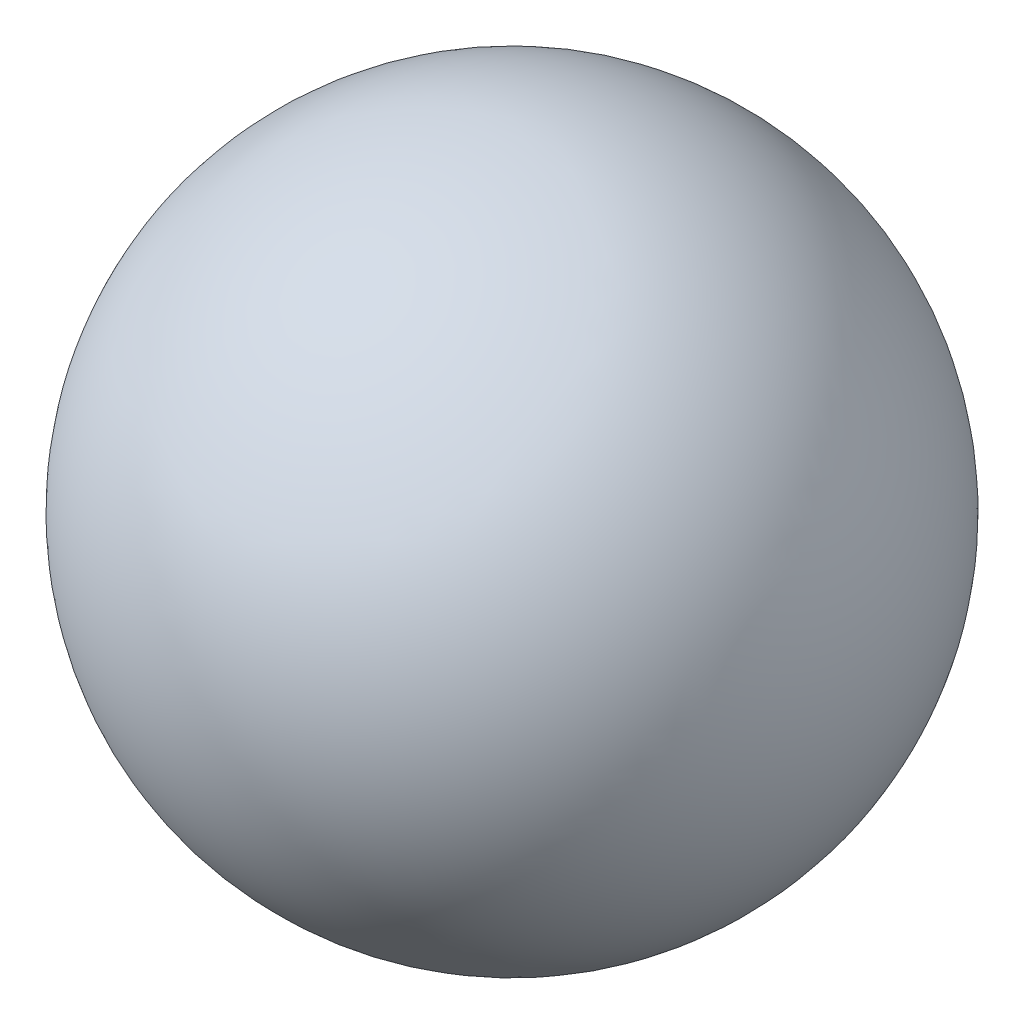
ISO-10303-21;
HEADER;
FILE_DESCRIPTION(('STEP AP214'),'2;1');
FILE_NAME('part.step','',(''),(''),'','','');
FILE_SCHEMA(('AUTOMOTIVE_DESIGN { 1 0 10303 214 1 1 1 1 }'));
ENDSEC;
DATA;
#1=APPLICATION_CONTEXT('core data for automotive mechanical design processes');
#2=APPLICATION_PROTOCOL_DEFINITION('international standard','automotive_design',2000,#1);
#3=PRODUCT_CONTEXT('',#1,'mechanical');
#4=PRODUCT('Part','Part','',(#3));
#5=PRODUCT_RELATED_PRODUCT_CATEGORY('part','',(#4));
#6=PRODUCT_DEFINITION_FORMATION('','',#4);
#7=PRODUCT_DEFINITION_CONTEXT('part definition',#1,'design');
#8=PRODUCT_DEFINITION('design','',#6,#7);
#9=PRODUCT_DEFINITION_SHAPE('','',#8);
#10=(LENGTH_UNIT() NAMED_UNIT(*) SI_UNIT(.MILLI.,.METRE.));
#11=(NAMED_UNIT(*) PLANE_ANGLE_UNIT() SI_UNIT($,.RADIAN.));
#12=(NAMED_UNIT(*) SI_UNIT($,.STERADIAN.) SOLID_ANGLE_UNIT());
#13=UNCERTAINTY_MEASURE_WITH_UNIT(LENGTH_MEASURE(1.E-05),#10,'distance_accuracy_value','');
#14=(GEOMETRIC_REPRESENTATION_CONTEXT(3) GLOBAL_UNCERTAINTY_ASSIGNED_CONTEXT((#13)) GLOBAL_UNIT_ASSIGNED_CONTEXT((#10,
#11,#12)) REPRESENTATION_CONTEXT('',''));
#15=CARTESIAN_POINT('',(0.,0.,0.));
#16=DIRECTION('',(0.,0.,1.));
#17=DIRECTION('',(1.,0.,0.));
#18=AXIS2_PLACEMENT_3D('',#15,#16,#17);
#19=CARTESIAN_POINT('',(5.4,0.,-4.9));
#20=DIRECTION('',(-1.,0.,0.));
#21=DIRECTION('',(0.,0.,-1.));
#22=AXIS2_PLACEMENT_3D('',#19,#20,#21);
#23=SPHERICAL_SURFACE('',#22,3.3);
#24=CARTESIAN_POINT('',(2.1,0.,-4.9));
#25=VERTEX_POINT('',#24);
#26=VERTEX_LOOP('',#25);
#27=FACE_BOUND('',#26,.T.);
#28=ADVANCED_FACE('F27',(#27),#23,.T.);
#29=CLOSED_SHELL('',(#28));
#30=MANIFOLD_SOLID_BREP('B2',#29);
#31=ADVANCED_BREP_SHAPE_REPRESENTATION('',(#18,#30),#14);
#32=SHAPE_DEFINITION_REPRESENTATION(#9,#31);
ENDSEC;
END-ISO-10303-21;
